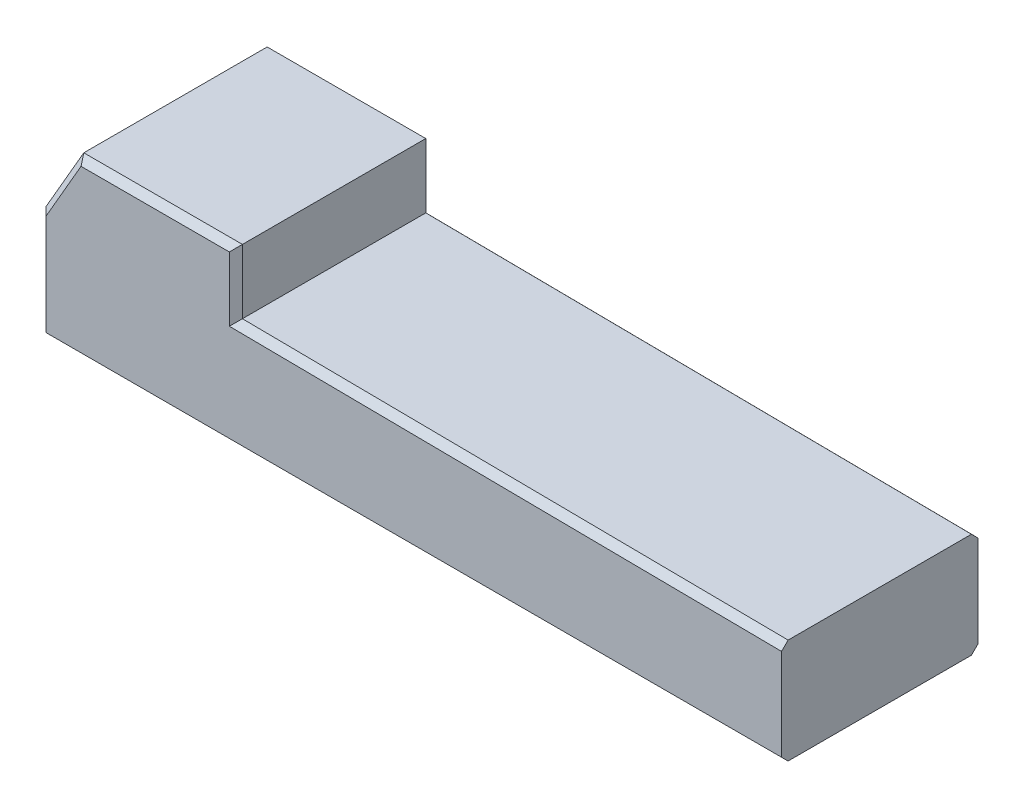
ISO-10303-21;
HEADER;
FILE_DESCRIPTION(('STEP AP214'),'2;1');
FILE_NAME('part.step','',(''),(''),'','','');
FILE_SCHEMA(('AUTOMOTIVE_DESIGN { 1 0 10303 214 1 1 1 1 }'));
ENDSEC;
DATA;
#1=APPLICATION_CONTEXT('core data for automotive mechanical design processes');
#2=APPLICATION_PROTOCOL_DEFINITION('international standard','automotive_design',2000,#1);
#3=PRODUCT_CONTEXT('',#1,'mechanical');
#4=PRODUCT('Part','Part','',(#3));
#5=PRODUCT_RELATED_PRODUCT_CATEGORY('part','',(#4));
#6=PRODUCT_DEFINITION_FORMATION('','',#4);
#7=PRODUCT_DEFINITION_CONTEXT('part definition',#1,'design');
#8=PRODUCT_DEFINITION('design','',#6,#7);
#9=PRODUCT_DEFINITION_SHAPE('','',#8);
#10=(LENGTH_UNIT() NAMED_UNIT(*) SI_UNIT(.MILLI.,.METRE.));
#11=(NAMED_UNIT(*) PLANE_ANGLE_UNIT() SI_UNIT($,.RADIAN.));
#12=(NAMED_UNIT(*) SI_UNIT($,.STERADIAN.) SOLID_ANGLE_UNIT());
#13=UNCERTAINTY_MEASURE_WITH_UNIT(LENGTH_MEASURE(1.E-05),#10,'distance_accuracy_value','');
#14=(GEOMETRIC_REPRESENTATION_CONTEXT(3) GLOBAL_UNCERTAINTY_ASSIGNED_CONTEXT((#13)) GLOBAL_UNIT_ASSIGNED_CONTEXT((#10,
#11,#12)) REPRESENTATION_CONTEXT('',''));
#15=CARTESIAN_POINT('',(0.,0.,0.));
#16=DIRECTION('',(0.,0.,1.));
#17=DIRECTION('',(1.,0.,0.));
#18=AXIS2_PLACEMENT_3D('',#15,#16,#17);
#19=CARTESIAN_POINT('',(80.,19.2,36.));
#20=DIRECTION('',(-1.,0.,0.));
#21=DIRECTION('',(0.,0.,1.));
#22=AXIS2_PLACEMENT_3D('',#19,#20,#21);
#23=PLANE('',#22);
#24=DIRECTION('',(0.,1.,0.));
#25=VECTOR('',#24,1.);
#26=CARTESIAN_POINT('',(80.,19.2,0.));
#27=LINE('',#26,#25);
#28=CARTESIAN_POINT('',(80.,1.20000000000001,0.));
#29=VERTEX_POINT('',#28);
#30=CARTESIAN_POINT('',(80.,17.9999400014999,0.));
#31=VERTEX_POINT('',#30);
#32=EDGE_CURVE('E192',#29,#31,#27,.T.);
#33=ORIENTED_EDGE('',*,*,#32,.T.);
#34=DIRECTION('',(0.,-0.707124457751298,-0.7070891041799));
#35=VECTOR('',#34,1.);
#36=CARTESIAN_POINT('',(80.,19.7000249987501,1.69999999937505));
#37=LINE('',#36,#35);
#38=CARTESIAN_POINT('',(80.,19.2,1.19999999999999));
#39=VERTEX_POINT('',#38);
#40=EDGE_CURVE('E154',#31,#39,#37,.F.);
#41=ORIENTED_EDGE('',*,*,#40,.T.);
#42=DIRECTION('',(0.,0.,-1.));
#43=VECTOR('',#42,1.);
#44=CARTESIAN_POINT('',(80.,19.2,36.));
#45=LINE('',#44,#43);
#46=CARTESIAN_POINT('',(80.,19.2,34.8));
#47=VERTEX_POINT('',#46);
#48=EDGE_CURVE('E161',#47,#39,#45,.T.);
#49=ORIENTED_EDGE('',*,*,#48,.F.);
#50=DIRECTION('',(0.,-0.707124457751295,0.707089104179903));
#51=VECTOR('',#50,1.);
#52=CARTESIAN_POINT('',(80.,18.6790060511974,35.3209679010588));
#53=LINE('',#52,#51);
#54=CARTESIAN_POINT('',(80.,17.9999400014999,36.));
#55=VERTEX_POINT('',#54);
#56=EDGE_CURVE('E167',#47,#55,#53,.T.);
#57=ORIENTED_EDGE('',*,*,#56,.T.);
#58=DIRECTION('',(0.,1.,0.));
#59=VECTOR('',#58,1.);
#60=CARTESIAN_POINT('',(80.,19.2,36.));
#61=LINE('',#60,#59);
#62=CARTESIAN_POINT('',(80.,1.2,36.));
#63=VERTEX_POINT('',#62);
#64=EDGE_CURVE('E257',#63,#55,#61,.T.);
#65=ORIENTED_EDGE('',*,*,#64,.F.);
#66=DIRECTION('',(0.,-0.707106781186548,-0.707106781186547));
#67=VECTOR('',#66,1.);
#68=CARTESIAN_POINT('',(80.,1.19999999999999,36.));
#69=LINE('',#68,#67);
#70=CARTESIAN_POINT('',(80.,0.,34.8));
#71=VERTEX_POINT('',#70);
#72=EDGE_CURVE('E233',#63,#71,#69,.T.);
#73=ORIENTED_EDGE('',*,*,#72,.T.);
#74=DIRECTION('',(0.,0.,-1.));
#75=VECTOR('',#74,1.);
#76=CARTESIAN_POINT('',(80.,0.,36.));
#77=LINE('',#76,#75);
#78=CARTESIAN_POINT('',(80.,0.,1.19999999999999));
#79=VERTEX_POINT('',#78);
#80=EDGE_CURVE('E171',#71,#79,#77,.T.);
#81=ORIENTED_EDGE('',*,*,#80,.T.);
#82=DIRECTION('',(0.,-0.707106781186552,0.707106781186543));
#83=VECTOR('',#82,1.);
#84=CARTESIAN_POINT('',(80.,0.,1.2));
#85=LINE('',#84,#83);
#86=EDGE_CURVE('E230',#79,#29,#85,.F.);
#87=ORIENTED_EDGE('',*,*,#86,.T.);
#88=EDGE_LOOP('',(#33,#41,#49,#57,#65,#73,#81,#87));
#89=FACE_BOUND('',#88,.T.);
#90=ADVANCED_FACE('F39',(#89),#23,.F.);
#91=CARTESIAN_POINT('',(-20.,20.2,36.));
#92=DIRECTION('',(-0.00999950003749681,-0.999950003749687,0.));
#93=DIRECTION('',(0.999950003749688,-0.00999950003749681,0.));
#94=AXIS2_PLACEMENT_3D('',#91,#92,#93);
#95=PLANE('',#94);
#96=ORIENTED_EDGE('',*,*,#48,.T.);
#97=DIRECTION('',(-0.999950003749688,0.00999950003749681,0.));
#98=VECTOR('',#97,1.);
#99=CARTESIAN_POINT('',(-20.,20.2,1.19999999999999));
#100=LINE('',#99,#98);
#101=CARTESIAN_POINT('',(-20.,20.2,1.19999999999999));
#102=VERTEX_POINT('',#101);
#103=EDGE_CURVE('E162',#39,#102,#100,.T.);
#104=ORIENTED_EDGE('',*,*,#103,.T.);
#105=DIRECTION('',(0.,0.,-1.));
#106=VECTOR('',#105,1.);
#107=CARTESIAN_POINT('',(-20.,20.2,36.));
#108=LINE('',#107,#106);
#109=CARTESIAN_POINT('',(-20.,20.2,34.8));
#110=VERTEX_POINT('',#109);
#111=EDGE_CURVE('E144',#110,#102,#108,.T.);
#112=ORIENTED_EDGE('',*,*,#111,.F.);
#113=DIRECTION('',(0.999950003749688,-0.00999950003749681,0.));
#114=VECTOR('',#113,1.);
#115=CARTESIAN_POINT('',(80.,19.2,34.8));
#116=LINE('',#115,#114);
#117=EDGE_CURVE('E159',#110,#47,#116,.T.);
#118=ORIENTED_EDGE('',*,*,#117,.T.);
#119=EDGE_LOOP('',(#96,#104,#112,#118));
#120=FACE_BOUND('',#119,.T.);
#121=ADVANCED_FACE('F156',(#120),#95,.F.);
#122=CARTESIAN_POINT('',(-20.,20.2,36.));
#123=DIRECTION('',(-1.,0.,0.));
#124=DIRECTION('',(0.,0.,1.));
#125=AXIS2_PLACEMENT_3D('',#122,#123,#124);
#126=PLANE('',#125);
#127=ORIENTED_EDGE('',*,*,#111,.T.);
#128=DIRECTION('',(0.,1.,0.));
#129=VECTOR('',#128,1.);
#130=CARTESIAN_POINT('',(-20.,20.2,1.19999999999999));
#131=LINE('',#130,#129);
#132=CARTESIAN_POINT('',(-20.,32.,1.19999999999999));
#133=VERTEX_POINT('',#132);
#134=EDGE_CURVE('E153',#102,#133,#131,.T.);
#135=ORIENTED_EDGE('',*,*,#134,.T.);
#136=DIRECTION('',(0.,0.,-1.));
#137=VECTOR('',#136,1.);
#138=CARTESIAN_POINT('',(-20.,32.,36.));
#139=LINE('',#138,#137);
#140=CARTESIAN_POINT('',(-20.,32.,34.8));
#141=VERTEX_POINT('',#140);
#142=EDGE_CURVE('E149',#141,#133,#139,.T.);
#143=ORIENTED_EDGE('',*,*,#142,.F.);
#144=DIRECTION('',(0.,-1.,0.));
#145=VECTOR('',#144,1.);
#146=CARTESIAN_POINT('',(-20.,20.2,34.8));
#147=LINE('',#146,#145);
#148=EDGE_CURVE('E142',#141,#110,#147,.T.);
#149=ORIENTED_EDGE('',*,*,#148,.T.);
#150=EDGE_LOOP('',(#127,#135,#143,#149));
#151=FACE_BOUND('',#150,.T.);
#152=ADVANCED_FACE('F141',(#151),#126,.F.);
#153=CARTESIAN_POINT('',(-49.0717967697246,32.,36.));
#154=DIRECTION('',(0.,-1.,0.));
#155=DIRECTION('',(1.,0.,0.));
#156=AXIS2_PLACEMENT_3D('',#153,#154,#155);
#157=PLANE('',#156);
#158=ORIENTED_EDGE('',*,*,#142,.T.);
#159=DIRECTION('',(-1.,0.,0.));
#160=VECTOR('',#159,1.);
#161=CARTESIAN_POINT('',(-49.0717967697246,32.,1.19999999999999));
#162=LINE('',#161,#160);
#163=CARTESIAN_POINT('',(-49.0717967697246,32.,1.19999999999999));
#164=VERTEX_POINT('',#163);
#165=EDGE_CURVE('E221',#133,#164,#162,.T.);
#166=ORIENTED_EDGE('',*,*,#165,.T.);
#167=DIRECTION('',(0.,0.,-1.));
#168=VECTOR('',#167,1.);
#169=CARTESIAN_POINT('',(-49.0717967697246,32.,36.));
#170=LINE('',#169,#168);
#171=CARTESIAN_POINT('',(-49.0717967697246,32.,34.8));
#172=VERTEX_POINT('',#171);
#173=EDGE_CURVE('E252',#172,#164,#170,.T.);
#174=ORIENTED_EDGE('',*,*,#173,.F.);
#175=DIRECTION('',(1.,0.,0.));
#176=VECTOR('',#175,1.);
#177=CARTESIAN_POINT('',(-20.,32.,34.8));
#178=LINE('',#177,#176);
#179=EDGE_CURVE('E222',#172,#141,#178,.T.);
#180=ORIENTED_EDGE('',*,*,#179,.T.);
#181=EDGE_LOOP('',(#158,#166,#174,#180));
#182=FACE_BOUND('',#181,.T.);
#183=ADVANCED_FACE('F283',(#182),#157,.F.);
#184=CARTESIAN_POINT('',(-56.,20.,36.));
#185=DIRECTION('',(0.866025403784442,-0.499999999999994,0.));
#186=DIRECTION('',(0.499999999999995,0.866025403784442,0.));
#187=AXIS2_PLACEMENT_3D('',#184,#185,#186);
#188=PLANE('',#187);
#189=ORIENTED_EDGE('',*,*,#173,.T.);
#190=DIRECTION('',(-0.499999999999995,-0.866025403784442,0.));
#191=VECTOR('',#190,1.);
#192=CARTESIAN_POINT('',(-56.,20.,1.19999999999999));
#193=LINE('',#192,#191);
#194=CARTESIAN_POINT('',(-56.,20.,1.19999999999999));
#195=VERTEX_POINT('',#194);
#196=EDGE_CURVE('E220',#164,#195,#193,.T.);
#197=ORIENTED_EDGE('',*,*,#196,.T.);
#198=DIRECTION('',(0.,0.,-1.));
#199=VECTOR('',#198,1.);
#200=CARTESIAN_POINT('',(-56.,20.,36.));
#201=LINE('',#200,#199);
#202=CARTESIAN_POINT('',(-56.,20.,34.8));
#203=VERTEX_POINT('',#202);
#204=EDGE_CURVE('E251',#203,#195,#201,.T.);
#205=ORIENTED_EDGE('',*,*,#204,.F.);
#206=DIRECTION('',(0.499999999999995,0.866025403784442,0.));
#207=VECTOR('',#206,1.);
#208=CARTESIAN_POINT('',(-49.0717967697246,32.,34.8));
#209=LINE('',#208,#207);
#210=EDGE_CURVE('E223',#203,#172,#209,.T.);
#211=ORIENTED_EDGE('',*,*,#210,.T.);
#212=EDGE_LOOP('',(#189,#197,#205,#211));
#213=FACE_BOUND('',#212,.T.);
#214=ADVANCED_FACE('F295',(#213),#188,.F.);
#215=CARTESIAN_POINT('',(-56.,20.,36.));
#216=DIRECTION('',(1.,0.,0.));
#217=DIRECTION('',(0.,0.,-1.));
#218=AXIS2_PLACEMENT_3D('',#215,#216,#217);
#219=PLANE('',#218);
#220=ORIENTED_EDGE('',*,*,#204,.T.);
#221=DIRECTION('',(0.,-1.,0.));
#222=VECTOR('',#221,1.);
#223=CARTESIAN_POINT('',(-56.,20.,1.19999999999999));
#224=LINE('',#223,#222);
#225=CARTESIAN_POINT('',(-56.,0.,1.19999999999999));
#226=VERTEX_POINT('',#225);
#227=EDGE_CURVE('E212',#195,#226,#224,.T.);
#228=ORIENTED_EDGE('',*,*,#227,.T.);
#229=DIRECTION('',(0.,0.,-1.));
#230=VECTOR('',#229,1.);
#231=CARTESIAN_POINT('',(-56.,0.,36.));
#232=LINE('',#231,#230);
#233=CARTESIAN_POINT('',(-56.,0.,34.8));
#234=VERTEX_POINT('',#233);
#235=EDGE_CURVE('E256',#234,#226,#232,.T.);
#236=ORIENTED_EDGE('',*,*,#235,.F.);
#237=DIRECTION('',(0.,1.,0.));
#238=VECTOR('',#237,1.);
#239=CARTESIAN_POINT('',(-56.,20.,34.8));
#240=LINE('',#239,#238);
#241=EDGE_CURVE('E219',#234,#203,#240,.T.);
#242=ORIENTED_EDGE('',*,*,#241,.T.);
#243=EDGE_LOOP('',(#220,#228,#236,#242));
#244=FACE_BOUND('',#243,.T.);
#245=ADVANCED_FACE('F296',(#244),#219,.F.);
#246=CARTESIAN_POINT('',(-56.,0.,36.));
#247=DIRECTION('',(0.,1.,0.));
#248=DIRECTION('',(-1.,0.,0.));
#249=AXIS2_PLACEMENT_3D('',#246,#247,#248);
#250=PLANE('',#249);
#251=ORIENTED_EDGE('',*,*,#235,.T.);
#252=DIRECTION('',(1.,0.,0.));
#253=VECTOR('',#252,1.);
#254=CARTESIAN_POINT('',(-56.,0.,1.19999999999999));
#255=LINE('',#254,#253);
#256=EDGE_CURVE('E214',#226,#79,#255,.T.);
#257=ORIENTED_EDGE('',*,*,#256,.T.);
#258=ORIENTED_EDGE('',*,*,#80,.F.);
#259=DIRECTION('',(-1.,0.,0.));
#260=VECTOR('',#259,1.);
#261=CARTESIAN_POINT('',(-56.,0.,34.8));
#262=LINE('',#261,#260);
#263=EDGE_CURVE('E215',#71,#234,#262,.T.);
#264=ORIENTED_EDGE('',*,*,#263,.T.);
#265=EDGE_LOOP('',(#251,#257,#258,#264));
#266=FACE_BOUND('',#265,.T.);
#267=ADVANCED_FACE('F311',(#266),#250,.F.);
#268=CARTESIAN_POINT('',(-56.,0.,36.));
#269=DIRECTION('',(0.,0.,1.));
#270=DIRECTION('',(1.,0.,0.));
#271=AXIS2_PLACEMENT_3D('',#268,#269,#270);
#272=PLANE('',#271);
#273=DIRECTION('',(0.,-1.,0.));
#274=VECTOR('',#273,1.);
#275=CARTESIAN_POINT('',(-54.8,0.,36.));
#276=LINE('',#275,#274);
#277=CARTESIAN_POINT('',(-54.8,19.6784609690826,36.));
#278=VERTEX_POINT('',#277);
#279=CARTESIAN_POINT('',(-54.8,1.19999999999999,36.));
#280=VERTEX_POINT('',#279);
#281=EDGE_CURVE('E48',#278,#280,#276,.T.);
#282=ORIENTED_EDGE('',*,*,#281,.T.);
#283=DIRECTION('',(1.,0.,0.));
#284=VECTOR('',#283,1.);
#285=CARTESIAN_POINT('',(80.,1.2,36.));
#286=LINE('',#285,#284);
#287=EDGE_CURVE('E11',#280,#63,#286,.T.);
#288=ORIENTED_EDGE('',*,*,#287,.T.);
#289=ORIENTED_EDGE('',*,*,#64,.T.);
#290=DIRECTION('',(-0.999950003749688,0.00999950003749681,0.));
#291=VECTOR('',#290,1.);
#292=CARTESIAN_POINT('',(-20.011999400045,19.0000599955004,36.));
#293=LINE('',#292,#291);
#294=CARTESIAN_POINT('',(-21.2,19.0119400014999,36.));
#295=VERTEX_POINT('',#294);
#296=EDGE_CURVE('E209',#55,#295,#293,.T.);
#297=ORIENTED_EDGE('',*,*,#296,.T.);
#298=DIRECTION('',(0.,1.,0.));
#299=VECTOR('',#298,1.);
#300=CARTESIAN_POINT('',(-21.2,32.,36.));
#301=LINE('',#300,#299);
#302=CARTESIAN_POINT('',(-21.2,30.8,36.));
#303=VERTEX_POINT('',#302);
#304=EDGE_CURVE('E172',#295,#303,#301,.T.);
#305=ORIENTED_EDGE('',*,*,#304,.T.);
#306=DIRECTION('',(-1.,0.,0.));
#307=VECTOR('',#306,1.);
#308=CARTESIAN_POINT('',(-49.0717967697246,30.8,36.));
#309=LINE('',#308,#307);
#310=CARTESIAN_POINT('',(-48.378976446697,30.8,36.));
#311=VERTEX_POINT('',#310);
#312=EDGE_CURVE('E207',#303,#311,#309,.T.);
#313=ORIENTED_EDGE('',*,*,#312,.T.);
#314=DIRECTION('',(-0.499999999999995,-0.866025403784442,0.));
#315=VECTOR('',#314,1.);
#316=CARTESIAN_POINT('',(-54.9607695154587,19.4,36.));
#317=LINE('',#316,#315);
#318=EDGE_CURVE('E56',#311,#278,#317,.T.);
#319=ORIENTED_EDGE('',*,*,#318,.T.);
#320=EDGE_LOOP('',(#282,#288,#289,#297,#305,#313,#319));
#321=FACE_BOUND('',#320,.T.);
#322=ADVANCED_FACE('F261',(#321),#272,.T.);
#323=CARTESIAN_POINT('',(-56.,0.,0.));
#324=DIRECTION('',(0.,0.,1.));
#325=DIRECTION('',(1.,0.,0.));
#326=AXIS2_PLACEMENT_3D('',#323,#324,#325);
#327=PLANE('',#326);
#328=DIRECTION('',(0.,-1.,0.));
#329=VECTOR('',#328,1.);
#330=CARTESIAN_POINT('',(-21.2,0.,0.));
#331=LINE('',#330,#329);
#332=CARTESIAN_POINT('',(-21.2,30.8,0.));
#333=VERTEX_POINT('',#332);
#334=CARTESIAN_POINT('',(-21.2,19.0119400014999,0.));
#335=VERTEX_POINT('',#334);
#336=EDGE_CURVE('E236',#333,#335,#331,.T.);
#337=ORIENTED_EDGE('',*,*,#336,.T.);
#338=DIRECTION('',(0.999950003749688,-0.00999950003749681,0.));
#339=VECTOR('',#338,1.);
#340=CARTESIAN_POINT('',(-55.8064199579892,19.3580042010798,0.));
#341=LINE('',#340,#339);
#342=EDGE_CURVE('E234',#335,#31,#341,.T.);
#343=ORIENTED_EDGE('',*,*,#342,.T.);
#344=ORIENTED_EDGE('',*,*,#32,.F.);
#345=DIRECTION('',(-1.,0.,0.));
#346=VECTOR('',#345,1.);
#347=CARTESIAN_POINT('',(-56.,1.2,0.));
#348=LINE('',#347,#346);
#349=CARTESIAN_POINT('',(-54.8,1.2,0.));
#350=VERTEX_POINT('',#349);
#351=EDGE_CURVE('E242',#29,#350,#348,.T.);
#352=ORIENTED_EDGE('',*,*,#351,.T.);
#353=DIRECTION('',(0.,1.,0.));
#354=VECTOR('',#353,1.);
#355=CARTESIAN_POINT('',(-54.8,0.,0.));
#356=LINE('',#355,#354);
#357=CARTESIAN_POINT('',(-54.8,19.6784609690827,0.));
#358=VERTEX_POINT('',#357);
#359=EDGE_CURVE('E245',#350,#358,#356,.T.);
#360=ORIENTED_EDGE('',*,*,#359,.T.);
#361=DIRECTION('',(0.499999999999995,0.866025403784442,0.));
#362=VECTOR('',#361,1.);
#363=CARTESIAN_POINT('',(-63.621023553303,4.39999999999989,0.));
#364=LINE('',#363,#362);
#365=CARTESIAN_POINT('',(-48.378976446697,30.8,0.));
#366=VERTEX_POINT('',#365);
#367=EDGE_CURVE('E239',#358,#366,#364,.T.);
#368=ORIENTED_EDGE('',*,*,#367,.T.);
#369=DIRECTION('',(1.,0.,0.));
#370=VECTOR('',#369,1.);
#371=CARTESIAN_POINT('',(-56.,30.8,0.));
#372=LINE('',#371,#370);
#373=EDGE_CURVE('E238',#366,#333,#372,.T.);
#374=ORIENTED_EDGE('',*,*,#373,.T.);
#375=EDGE_LOOP('',(#337,#343,#344,#352,#360,#368,#374));
#376=FACE_BOUND('',#375,.T.);
#377=ADVANCED_FACE('F314',(#376),#327,.F.);
#378=CARTESIAN_POINT('',(-56.,0.,1.19999999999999));
#379=DIRECTION('',(0.,0.707106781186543,0.707106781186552));
#380=DIRECTION('',(0.,-0.707106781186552,0.707106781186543));
#381=AXIS2_PLACEMENT_3D('',#378,#379,#380);
#382=PLANE('',#381);
#383=ORIENTED_EDGE('',*,*,#86,.F.);
#384=ORIENTED_EDGE('',*,*,#256,.F.);
#385=DIRECTION('',(0.577350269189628,0.577350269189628,-0.577350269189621));
#386=VECTOR('',#385,1.);
#387=CARTESIAN_POINT('',(-56.,0.,1.19999999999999));
#388=LINE('',#387,#386);
#389=EDGE_CURVE('E191',#350,#226,#388,.F.);
#390=ORIENTED_EDGE('',*,*,#389,.F.);
#391=ORIENTED_EDGE('',*,*,#351,.F.);
#392=EDGE_LOOP('',(#383,#384,#390,#391));
#393=FACE_BOUND('',#392,.T.);
#394=ADVANCED_FACE('F307',(#393),#382,.F.);
#395=CARTESIAN_POINT('',(-56.,20.,1.19999999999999));
#396=DIRECTION('',(0.707106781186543,0.,0.707106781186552));
#397=DIRECTION('',(0.707106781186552,0.,-0.707106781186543));
#398=AXIS2_PLACEMENT_3D('',#395,#396,#397);
#399=PLANE('',#398);
#400=ORIENTED_EDGE('',*,*,#389,.T.);
#401=ORIENTED_EDGE('',*,*,#227,.F.);
#402=DIRECTION('',(0.694746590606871,-0.186156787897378,-0.694746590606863));
#403=VECTOR('',#402,1.);
#404=CARTESIAN_POINT('',(-56.,20.,1.19999999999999));
#405=LINE('',#404,#403);
#406=EDGE_CURVE('E198',#358,#195,#405,.F.);
#407=ORIENTED_EDGE('',*,*,#406,.F.);
#408=ORIENTED_EDGE('',*,*,#359,.F.);
#409=EDGE_LOOP('',(#400,#401,#407,#408));
#410=FACE_BOUND('',#409,.T.);
#411=ADVANCED_FACE('F305',(#410),#399,.F.);
#412=CARTESIAN_POINT('',(-56.,20.,1.19999999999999));
#413=DIRECTION('',(0.612372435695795,-0.353553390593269,0.70710678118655));
#414=DIRECTION('',(0.755928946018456,0.,-0.654653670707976));
#415=AXIS2_PLACEMENT_3D('',#412,#413,#414);
#416=PLANE('',#415);
#417=ORIENTED_EDGE('',*,*,#406,.T.);
#418=ORIENTED_EDGE('',*,*,#196,.F.);
#419=DIRECTION('',(0.377964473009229,-0.65465367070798,-0.654653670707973));
#420=VECTOR('',#419,1.);
#421=CARTESIAN_POINT('',(-47.092310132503,28.5714285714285,-2.22857142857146));
#422=LINE('',#421,#420);
#423=EDGE_CURVE('E200',#366,#164,#422,.F.);
#424=ORIENTED_EDGE('',*,*,#423,.F.);
#425=ORIENTED_EDGE('',*,*,#367,.F.);
#426=EDGE_LOOP('',(#417,#418,#424,#425));
#427=FACE_BOUND('',#426,.T.);
#428=ADVANCED_FACE('F287',(#427),#416,.F.);
#429=CARTESIAN_POINT('',(-49.0717967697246,32.,1.19999999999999));
#430=DIRECTION('',(0.,-0.707106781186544,0.707106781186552));
#431=DIRECTION('',(0.,-0.707106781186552,-0.707106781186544));
#432=AXIS2_PLACEMENT_3D('',#429,#430,#431);
#433=PLANE('',#432);
#434=ORIENTED_EDGE('',*,*,#423,.T.);
#435=ORIENTED_EDGE('',*,*,#165,.F.);
#436=DIRECTION('',(-0.577350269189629,-0.577350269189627,-0.577350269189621));
#437=VECTOR('',#436,1.);
#438=CARTESIAN_POINT('',(-29.6905989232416,22.3094010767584,-8.49059892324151));
#439=LINE('',#438,#437);
#440=EDGE_CURVE('E180',#333,#133,#439,.F.);
#441=ORIENTED_EDGE('',*,*,#440,.F.);
#442=ORIENTED_EDGE('',*,*,#373,.F.);
#443=EDGE_LOOP('',(#434,#435,#441,#442));
#444=FACE_BOUND('',#443,.T.);
#445=ADVANCED_FACE('F285',(#444),#433,.F.);
#446=CARTESIAN_POINT('',(-20.,20.2,1.19999999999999));
#447=DIRECTION('',(-0.707106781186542,0.,0.707106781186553));
#448=DIRECTION('',(0.707106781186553,0.,0.707106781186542));
#449=AXIS2_PLACEMENT_3D('',#446,#447,#448);
#450=PLANE('',#449);
#451=ORIENTED_EDGE('',*,*,#440,.T.);
#452=ORIENTED_EDGE('',*,*,#134,.F.);
#453=DIRECTION('',(-0.579265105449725,-0.573501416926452,-0.579265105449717));
#454=VECTOR('',#453,1.);
#455=CARTESIAN_POINT('',(-20.,20.2,1.19999999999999));
#456=LINE('',#455,#454);
#457=EDGE_CURVE('E174',#335,#102,#456,.F.);
#458=ORIENTED_EDGE('',*,*,#457,.F.);
#459=ORIENTED_EDGE('',*,*,#336,.F.);
#460=EDGE_LOOP('',(#451,#452,#458,#459));
#461=FACE_BOUND('',#460,.T.);
#462=ADVANCED_FACE('F276',(#461),#450,.F.);
#463=CARTESIAN_POINT('',(-20.,20.2,1.19999999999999));
#464=DIRECTION('',(-0.0070707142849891,-0.707071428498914,0.707106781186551));
#465=DIRECTION('',(0.,-0.707124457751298,-0.7070891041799));
#466=AXIS2_PLACEMENT_3D('',#463,#464,#465);
#467=PLANE('',#466);
#468=ORIENTED_EDGE('',*,*,#40,.F.);
#469=ORIENTED_EDGE('',*,*,#342,.F.);
#470=ORIENTED_EDGE('',*,*,#457,.T.);
#471=ORIENTED_EDGE('',*,*,#103,.F.);
#472=EDGE_LOOP('',(#468,#469,#470,#471));
#473=FACE_BOUND('',#472,.T.);
#474=ADVANCED_FACE('F272',(#473),#467,.F.);
#475=CARTESIAN_POINT('',(-55.8064199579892,19.3580042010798,36.));
#476=DIRECTION('',(0.00707071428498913,0.707071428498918,0.707106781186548));
#477=DIRECTION('',(0.,-0.707124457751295,0.707089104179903));
#478=AXIS2_PLACEMENT_3D('',#475,#476,#477);
#479=PLANE('',#478);
#480=ORIENTED_EDGE('',*,*,#56,.F.);
#481=ORIENTED_EDGE('',*,*,#117,.F.);
#482=DIRECTION('',(-0.579265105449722,-0.573501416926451,0.57926510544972));
#483=VECTOR('',#482,1.);
#484=CARTESIAN_POINT('',(-27.5159443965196,12.7588392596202,42.3159443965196));
#485=LINE('',#484,#483);
#486=EDGE_CURVE('E43',#295,#110,#485,.F.);
#487=ORIENTED_EDGE('',*,*,#486,.F.);
#488=ORIENTED_EDGE('',*,*,#296,.F.);
#489=EDGE_LOOP('',(#480,#481,#487,#488));
#490=FACE_BOUND('',#489,.T.);
#491=ADVANCED_FACE('F41',(#490),#479,.T.);
#492=CARTESIAN_POINT('',(-21.2,0.,36.));
#493=DIRECTION('',(0.707106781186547,0.,0.707106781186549));
#494=DIRECTION('',(0.707106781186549,0.,-0.707106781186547));
#495=AXIS2_PLACEMENT_3D('',#492,#493,#494);
#496=PLANE('',#495);
#497=ORIENTED_EDGE('',*,*,#486,.T.);
#498=ORIENTED_EDGE('',*,*,#148,.F.);
#499=DIRECTION('',(-0.577350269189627,-0.577350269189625,0.577350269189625));
#500=VECTOR('',#499,1.);
#501=CARTESIAN_POINT('',(-31.4666666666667,20.5333333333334,46.2666666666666));
#502=LINE('',#501,#500);
#503=EDGE_CURVE('E176',#303,#141,#502,.F.);
#504=ORIENTED_EDGE('',*,*,#503,.F.);
#505=ORIENTED_EDGE('',*,*,#304,.F.);
#506=EDGE_LOOP('',(#497,#498,#504,#505));
#507=FACE_BOUND('',#506,.T.);
#508=ADVANCED_FACE('F173',(#507),#496,.T.);
#509=CARTESIAN_POINT('',(-56.,30.8,36.));
#510=DIRECTION('',(0.,0.707106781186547,0.707106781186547));
#511=DIRECTION('',(0.,-0.707106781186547,0.707106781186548));
#512=AXIS2_PLACEMENT_3D('',#509,#510,#511);
#513=PLANE('',#512);
#514=ORIENTED_EDGE('',*,*,#503,.T.);
#515=ORIENTED_EDGE('',*,*,#179,.F.);
#516=DIRECTION('',(0.377964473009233,-0.654653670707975,0.654653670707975));
#517=VECTOR('',#516,1.);
#518=CARTESIAN_POINT('',(-49.4676940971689,32.6857142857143,34.1142857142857));
#519=LINE('',#518,#517);
#520=EDGE_CURVE('E177',#311,#172,#519,.F.);
#521=ORIENTED_EDGE('',*,*,#520,.F.);
#522=ORIENTED_EDGE('',*,*,#312,.F.);
#523=EDGE_LOOP('',(#514,#515,#521,#522));
#524=FACE_BOUND('',#523,.T.);
#525=ADVANCED_FACE('F354',(#524),#513,.T.);
#526=CARTESIAN_POINT('',(-63.621023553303,4.39999999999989,36.));
#527=DIRECTION('',(-0.612372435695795,0.353553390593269,0.70710678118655));
#528=DIRECTION('',(0.755928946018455,0.,0.654653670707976));
#529=AXIS2_PLACEMENT_3D('',#526,#527,#528);
#530=PLANE('',#529);
#531=ORIENTED_EDGE('',*,*,#520,.T.);
#532=ORIENTED_EDGE('',*,*,#210,.F.);
#533=DIRECTION('',(0.694746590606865,-0.186156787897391,0.694746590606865));
#534=VECTOR('',#533,1.);
#535=CARTESIAN_POINT('',(-57.0816775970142,20.2898346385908,33.7183224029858));
#536=LINE('',#535,#534);
#537=EDGE_CURVE('E183',#278,#203,#536,.F.);
#538=ORIENTED_EDGE('',*,*,#537,.F.);
#539=ORIENTED_EDGE('',*,*,#318,.F.);
#540=EDGE_LOOP('',(#531,#532,#538,#539));
#541=FACE_BOUND('',#540,.T.);
#542=ADVANCED_FACE('F346',(#541),#530,.T.);
#543=CARTESIAN_POINT('',(-54.8,0.,36.));
#544=DIRECTION('',(-0.707106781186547,0.,0.707106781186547));
#545=DIRECTION('',(0.707106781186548,0.,0.707106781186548));
#546=AXIS2_PLACEMENT_3D('',#543,#544,#545);
#547=PLANE('',#546);
#548=ORIENTED_EDGE('',*,*,#537,.T.);
#549=ORIENTED_EDGE('',*,*,#241,.F.);
#550=DIRECTION('',(0.577350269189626,0.577350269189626,0.577350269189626));
#551=VECTOR('',#550,1.);
#552=CARTESIAN_POINT('',(-55.2,0.79999999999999,35.6));
#553=LINE('',#552,#551);
#554=EDGE_CURVE('E186',#280,#234,#553,.F.);
#555=ORIENTED_EDGE('',*,*,#554,.F.);
#556=ORIENTED_EDGE('',*,*,#281,.F.);
#557=EDGE_LOOP('',(#548,#549,#555,#556));
#558=FACE_BOUND('',#557,.T.);
#559=ADVANCED_FACE('F348',(#558),#547,.T.);
#560=CARTESIAN_POINT('',(-56.,1.19999999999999,36.));
#561=DIRECTION('',(0.,-0.707106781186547,0.707106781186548));
#562=DIRECTION('',(0.,-0.707106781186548,-0.707106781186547));
#563=AXIS2_PLACEMENT_3D('',#560,#561,#562);
#564=PLANE('',#563);
#565=ORIENTED_EDGE('',*,*,#554,.T.);
#566=ORIENTED_EDGE('',*,*,#263,.F.);
#567=ORIENTED_EDGE('',*,*,#72,.F.);
#568=ORIENTED_EDGE('',*,*,#287,.F.);
#569=EDGE_LOOP('',(#565,#566,#567,#568));
#570=FACE_BOUND('',#569,.T.);
#571=ADVANCED_FACE('F345',(#570),#564,.T.);
#572=CLOSED_SHELL('',(#90,#121,#152,#183,#214,#245,#267,#322,#377,#394,#411,#428,#445,#462,#474,
#491,#508,#525,#542,#559,#571));
#573=MANIFOLD_SOLID_BREP('B2',#572);
#574=ADVANCED_BREP_SHAPE_REPRESENTATION('',(#18,#573),#14);
#575=SHAPE_DEFINITION_REPRESENTATION(#9,#574);
ENDSEC;
END-ISO-10303-21;
